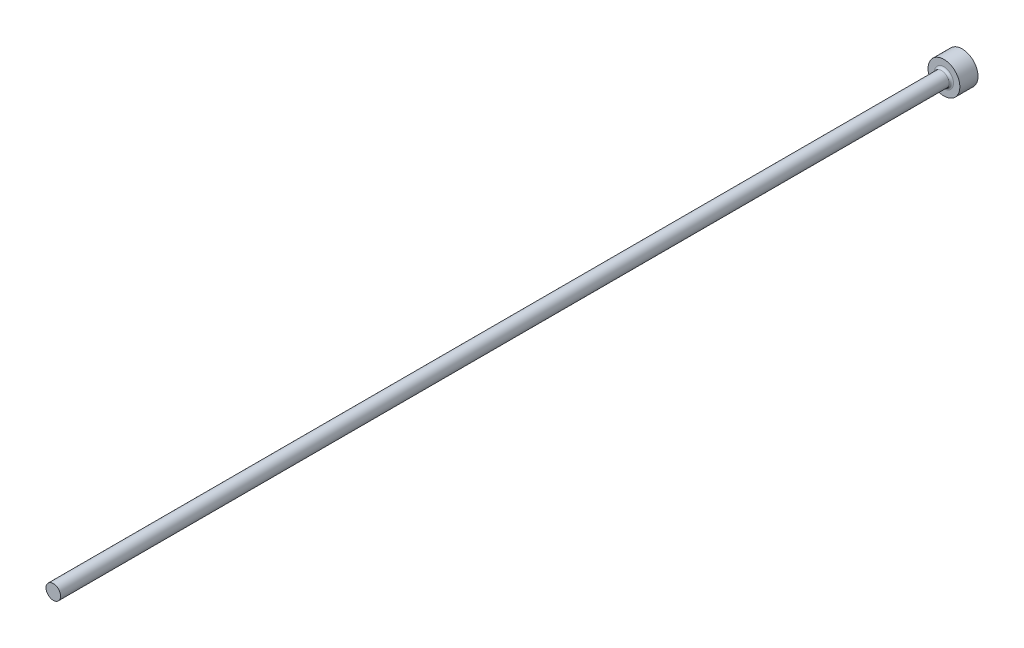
ISO-10303-21;
HEADER;
FILE_DESCRIPTION(('STEP AP214'),'2;1');
FILE_NAME('part.step','',(''),(''),'','','');
FILE_SCHEMA(('AUTOMOTIVE_DESIGN { 1 0 10303 214 1 1 1 1 }'));
ENDSEC;
DATA;
#1=APPLICATION_CONTEXT('core data for automotive mechanical design processes');
#2=APPLICATION_PROTOCOL_DEFINITION('international standard','automotive_design',2000,#1);
#3=PRODUCT_CONTEXT('',#1,'mechanical');
#4=PRODUCT('Part','Part','',(#3));
#5=PRODUCT_RELATED_PRODUCT_CATEGORY('part','',(#4));
#6=PRODUCT_DEFINITION_FORMATION('','',#4);
#7=PRODUCT_DEFINITION_CONTEXT('part definition',#1,'design');
#8=PRODUCT_DEFINITION('design','',#6,#7);
#9=PRODUCT_DEFINITION_SHAPE('','',#8);
#10=(LENGTH_UNIT() NAMED_UNIT(*) SI_UNIT(.MILLI.,.METRE.));
#11=(NAMED_UNIT(*) PLANE_ANGLE_UNIT() SI_UNIT($,.RADIAN.));
#12=(NAMED_UNIT(*) SI_UNIT($,.STERADIAN.) SOLID_ANGLE_UNIT());
#13=UNCERTAINTY_MEASURE_WITH_UNIT(LENGTH_MEASURE(1.E-05),#10,'distance_accuracy_value','');
#14=(GEOMETRIC_REPRESENTATION_CONTEXT(3) GLOBAL_UNCERTAINTY_ASSIGNED_CONTEXT((#13)) GLOBAL_UNIT_ASSIGNED_CONTEXT((#10,
#11,#12)) REPRESENTATION_CONTEXT('',''));
#15=CARTESIAN_POINT('',(0.,0.,0.));
#16=DIRECTION('',(0.,0.,1.));
#17=DIRECTION('',(1.,0.,0.));
#18=AXIS2_PLACEMENT_3D('',#15,#16,#17);
#19=CARTESIAN_POINT('',(3.5,0.,4.));
#20=DIRECTION('',(0.,0.,-1.));
#21=DIRECTION('',(-1.,0.,0.));
#22=AXIS2_PLACEMENT_3D('',#19,#20,#21);
#23=PLANE('',#22);
#24=CARTESIAN_POINT('',(0.,0.,4.));
#25=DIRECTION('',(0.,0.,-1.));
#26=DIRECTION('',(-1.,0.,0.));
#27=AXIS2_PLACEMENT_3D('',#24,#25,#26);
#28=CIRCLE('',#27,2.10000000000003);
#29=CARTESIAN_POINT('',(-2.10000000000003,0.,4.));
#30=VERTEX_POINT('',#29);
#31=EDGE_CURVE('E40',#30,#30,#28,.T.);
#32=ORIENTED_EDGE('',*,*,#31,.T.);
#33=EDGE_LOOP('',(#32));
#34=FACE_BOUND('',#33,.T.);
#35=CARTESIAN_POINT('',(0.,0.,4.));
#36=DIRECTION('',(0.,0.,-1.));
#37=DIRECTION('',(-1.,0.,0.));
#38=AXIS2_PLACEMENT_3D('',#35,#36,#37);
#39=CIRCLE('',#38,3.5);
#40=CARTESIAN_POINT('',(-3.5,0.,4.));
#41=VERTEX_POINT('',#40);
#42=EDGE_CURVE('E44',#41,#41,#39,.T.);
#43=ORIENTED_EDGE('',*,*,#42,.F.);
#44=EDGE_LOOP('',(#43));
#45=FACE_BOUND('',#44,.T.);
#46=ADVANCED_FACE('F33',(#34,#45),#23,.F.);
#47=CARTESIAN_POINT('',(0.,0.,-9.03322817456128));
#48=DIRECTION('',(0.,0.,-1.));
#49=DIRECTION('',(-1.,0.,0.));
#50=AXIS2_PLACEMENT_3D('',#47,#48,#49);
#51=CYLINDRICAL_SURFACE('',#50,3.5);
#52=CARTESIAN_POINT('',(0.,0.,0.));
#53=DIRECTION('',(0.,0.,-1.));
#54=DIRECTION('',(-1.,0.,0.));
#55=AXIS2_PLACEMENT_3D('',#52,#53,#54);
#56=CIRCLE('',#55,3.5);
#57=CARTESIAN_POINT('',(-3.5,0.,0.));
#58=VERTEX_POINT('',#57);
#59=EDGE_CURVE('E48',#58,#58,#56,.T.);
#60=ORIENTED_EDGE('',*,*,#59,.F.);
#61=EDGE_LOOP('',(#60));
#62=FACE_BOUND('',#61,.T.);
#63=ORIENTED_EDGE('',*,*,#42,.T.);
#64=EDGE_LOOP('',(#63));
#65=FACE_BOUND('',#64,.T.);
#66=ADVANCED_FACE('F68',(#62,#65),#51,.T.);
#67=CARTESIAN_POINT('',(0.,0.,0.));
#68=DIRECTION('',(0.,0.,1.));
#69=DIRECTION('',(1.,0.,0.));
#70=AXIS2_PLACEMENT_3D('',#67,#68,#69);
#71=PLANE('',#70);
#72=ORIENTED_EDGE('',*,*,#59,.T.);
#73=EDGE_LOOP('',(#72));
#74=FACE_BOUND('',#73,.T.);
#75=ADVANCED_FACE('F61',(#74),#71,.F.);
#76=CARTESIAN_POINT('',(0.,0.,200.));
#77=DIRECTION('',(0.,0.,-1.));
#78=DIRECTION('',(-1.,0.,0.));
#79=AXIS2_PLACEMENT_3D('',#76,#77,#78);
#80=PLANE('',#79);
#81=CARTESIAN_POINT('',(0.,0.,200.));
#82=DIRECTION('',(0.,0.,-1.));
#83=DIRECTION('',(-1.,0.,0.));
#84=AXIS2_PLACEMENT_3D('',#81,#82,#83);
#85=CIRCLE('',#84,1.60000000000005);
#86=CARTESIAN_POINT('',(-1.60000000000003,0.,200.));
#87=VERTEX_POINT('',#86);
#88=EDGE_CURVE('E53',#87,#87,#85,.T.);
#89=ORIENTED_EDGE('',*,*,#88,.F.);
#90=EDGE_LOOP('',(#89));
#91=FACE_BOUND('',#90,.T.);
#92=ADVANCED_FACE('F59',(#91),#80,.F.);
#93=CARTESIAN_POINT('',(0.,0.,-9.03322817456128));
#94=DIRECTION('',(0.,0.,-1.));
#95=DIRECTION('',(-1.,0.,0.));
#96=AXIS2_PLACEMENT_3D('',#93,#94,#95);
#97=CYLINDRICAL_SURFACE('',#96,1.60000000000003);
#98=CARTESIAN_POINT('',(0.,0.,4.5));
#99=DIRECTION('',(0.,0.,-1.));
#100=DIRECTION('',(-1.,0.,0.));
#101=AXIS2_PLACEMENT_3D('',#98,#99,#100);
#102=CIRCLE('',#101,1.60000000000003);
#103=CARTESIAN_POINT('',(-1.60000000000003,0.,4.5));
#104=VERTEX_POINT('',#103);
#105=EDGE_CURVE('E10',#104,#104,#102,.F.);
#106=ORIENTED_EDGE('',*,*,#105,.T.);
#107=EDGE_LOOP('',(#106));
#108=FACE_BOUND('',#107,.T.);
#109=ORIENTED_EDGE('',*,*,#88,.T.);
#110=EDGE_LOOP('',(#109));
#111=FACE_BOUND('',#110,.T.);
#112=ADVANCED_FACE('F57',(#108,#111),#97,.T.);
#113=CARTESIAN_POINT('',(0.,0.,4.5));
#114=DIRECTION('',(0.,0.,-1.));
#115=DIRECTION('',(-1.,0.,0.));
#116=AXIS2_PLACEMENT_3D('',#113,#114,#115);
#117=TOROIDAL_SURFACE('',#116,2.10000000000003,0.5);
#118=ORIENTED_EDGE('',*,*,#105,.F.);
#119=EDGE_LOOP('',(#118));
#120=FACE_BOUND('',#119,.T.);
#121=ORIENTED_EDGE('',*,*,#31,.F.);
#122=EDGE_LOOP('',(#121));
#123=FACE_BOUND('',#122,.T.);
#124=ADVANCED_FACE('F35',(#120,#123),#117,.F.);
#125=CLOSED_SHELL('',(#46,#66,#75,#92,#112,#124));
#126=MANIFOLD_SOLID_BREP('B2',#125);
#127=ADVANCED_BREP_SHAPE_REPRESENTATION('',(#18,#126),#14);
#128=SHAPE_DEFINITION_REPRESENTATION(#9,#127);
ENDSEC;
END-ISO-10303-21;
